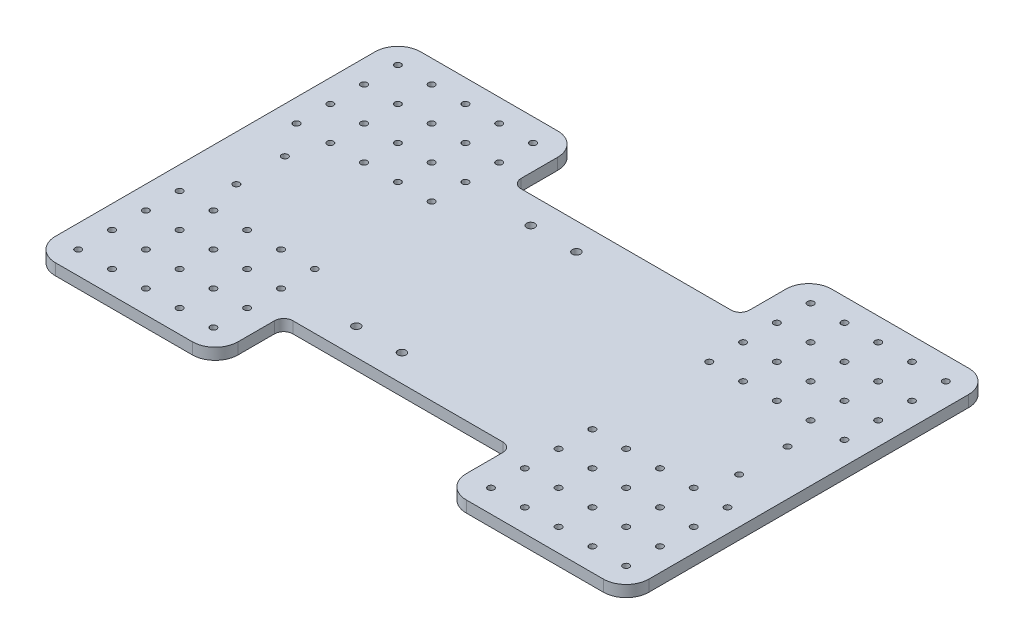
from build123d import *

# Parameters (mm, degrees)
SKETCH2_W             = 165.1
SKETCH2_H             = 101.6
BOSS_EXTRUDE1_DEPTH   = 3.175
SKETCH6_W             = 63.5
SKETCH6_H             = 3.175
CUT_EXTRUDE2_DEPTH    = 19.05
F_4_40_TAPPED_HOLE3_D = 2.2606
F_2_56_TAPPED_HOLE1_D = 1.778
FILLET1_R             = 6.35
F_2_56_TAPPED_HOLE2_D = 1.778
LPATTERN1_COUNT       = 5
LPATTERN1_PITCH       = 9.398
LPATTERN1_COUNT_DIR2  = 4
LPATTERN1_PITCH_DIR2  = 9.398
MIRROR3_COPY_1_D      = 1.778
MIRROR3_COPY_2_D      = 1.778
MIRROR3_COPY_3_D      = 1.778
MIRROR3_COPY_4_D      = 1.778
MIRROR3_COPY_5_D      = 1.778
MIRROR3_COPY_6_D      = 1.778
MIRROR3_COPY_7_D      = 1.778
MIRROR3_COPY_8_D      = 1.778
MIRROR3_COPY_9_D      = 1.778
MIRROR3_COPY_10_D     = 1.778
MIRROR3_COPY_11_D     = 1.778
MIRROR3_COPY_12_D     = 1.778
MIRROR3_COPY_13_D     = 1.778
MIRROR3_COPY_14_D     = 1.778
MIRROR3_COPY_15_D     = 1.778
MIRROR3_COPY_16_D     = 1.778
MIRROR3_COPY_17_D     = 1.778
MIRROR3_COPY_18_D     = 1.778
MIRROR3_COPY_19_D     = 1.778
FILLET3_R             = 2.54
MIRROR4_COPY_1_D      = 1.778
MIRROR4_COPY_2_D      = 1.778
MIRROR4_COPY_3_D      = 1.778
MIRROR4_COPY_4_D      = 1.778
MIRROR4_COPY_5_D      = 1.778
MIRROR4_COPY_6_D      = 1.778
MIRROR4_COPY_7_D      = 1.778
MIRROR4_COPY_8_D      = 1.778
MIRROR4_COPY_9_D      = 1.778
MIRROR4_COPY_10_D     = 1.778
MIRROR4_COPY_11_D     = 1.778
MIRROR4_COPY_12_D     = 1.778
MIRROR4_COPY_13_D     = 1.778
MIRROR4_COPY_14_D     = 1.778
MIRROR4_COPY_15_D     = 1.778
MIRROR4_COPY_16_D     = 1.778
MIRROR4_COPY_17_D     = 1.778
MIRROR4_COPY_18_D     = 1.778
MIRROR4_COPY_19_D     = 1.778
MIRROR4_COPY_20_D     = 1.778
MIRROR4_COPY_21_D     = 1.778
MIRROR4_COPY_22_D     = 1.778
MIRROR4_COPY_23_D     = 1.778
MIRROR4_COPY_24_D     = 1.778
MIRROR4_COPY_25_D     = 1.778
MIRROR4_COPY_26_D     = 1.778
MIRROR4_COPY_27_D     = 1.778
MIRROR4_COPY_28_D     = 1.778
MIRROR4_COPY_29_D     = 1.778
MIRROR4_COPY_30_D     = 1.778
MIRROR4_COPY_31_D     = 1.778
MIRROR4_COPY_32_D     = 1.778
MIRROR4_COPY_33_D     = 1.778
MIRROR4_COPY_34_D     = 1.778
MIRROR4_COPY_35_D     = 1.778
MIRROR4_COPY_36_D     = 1.778
MIRROR4_COPY_37_D     = 1.778
MIRROR4_COPY_38_D     = 1.778
MIRROR4_COPY_39_D     = 1.778


with BuildPart() as part:
    # Sketch2 → Boss-Extrude1 (new body)
    with BuildSketch(Plane(origin=(0, 0, 0), x_dir=(1, 0, 0), z_dir=(0, 1, 0))):
        Rectangle(SKETCH2_W, SKETCH2_H)
    extrude(amount=BOSS_EXTRUDE1_DEPTH)

    # Sketch6 → Cut-Extrude2 (cut)
    with BuildSketch(Plane.XY.offset(50.8)):
        with Locations((0, 1.5875)):
            Rectangle(SKETCH6_W, SKETCH6_H)
    cut_extrude2 = extrude(amount=-CUT_EXTRUDE2_DEPTH, mode=Mode.SUBTRACT)

    # Mirror2: Cut-Extrude2 across plane
    add(cut_extrude2.mirror(Plane.XY), mode=Mode.SUBTRACT)

    # 4-40 Tapped Hole3 (through all)
    with Locations(Plane(origin=(0, 3.175, 0), x_dir=(1, 0, 0), z_dir=(0, 1, 0))):
        with Locations((-6.35, 24.257), (-6.35, -24.257), (-19.05, 24.257), (-19.05, -24.257)):
            Hole(F_4_40_TAPPED_HOLE3_D / 2)

    # 2-56 Tapped Hole1 (through all)
    with Locations(Plane(origin=(0, 0, 0), x_dir=(-1, 0, 0), z_dir=(0, -1, 0))):
        with Locations((69.920806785, -6.731), (69.920806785, 6.731)):
            f_2_56_tapped_hole1 = Hole(F_2_56_TAPPED_HOLE1_D / 2)

    # Fillet1
    fillet1_edges = [part.edges().sort_by_distance(p)[0] for p in [
        (-31.75, 1.5875, 50.8),
        (31.75, 1.5875, 50.8),
        (-31.75, 1.5875, -50.8),
        (31.75, 1.5875, -50.8),
        (82.55, 1.5875, 50.8),
        (-82.55, 1.5875, 50.8),
        (-82.55, 1.5875, -50.8),
        (82.55, 1.5875, -50.8),
    ]]
    fillet(fillet1_edges, radius=FILLET1_R)

    # 2-56 Tapped Hole2 (through all)
    with Locations(Plane(origin=(0, 3.175, 0), x_dir=(1, 0, 0), z_dir=(0, 1, 0))):
        with Locations((-76.2, 44.45)):
            f_2_56_tapped_hole2 = Hole(F_2_56_TAPPED_HOLE2_D / 2)

    # LPattern1: 2-56 Tapped Hole2 5 × 4
    with Locations(*[(i * LPATTERN1_PITCH, 0, j * LPATTERN1_PITCH_DIR2) for i in range(LPATTERN1_COUNT) for j in range(LPATTERN1_COUNT_DIR2) if (i, j) != (0, 0)]):
        add(f_2_56_tapped_hole2, mode=Mode.SUBTRACT)

    # Mirror3: 2-56 Tapped Hole2 across plane
    add(f_2_56_tapped_hole2.mirror(Plane.XY), mode=Mode.SUBTRACT)

    # Mirror3 copy 1 (through all)
    with Locations(Plane(origin=(0, 3.175, -9.398), x_dir=(1, 0, 0), z_dir=(0, 1, 0))):
        with Locations((-76.2, -44.45)):
            Hole(MIRROR3_COPY_1_D / 2)

    # Mirror3 copy 2 (through all)
    with Locations(Plane(origin=(0, 3.175, -18.796), x_dir=(1, 0, 0), z_dir=(0, 1, 0))):
        with Locations((-76.2, -44.45)):
            Hole(MIRROR3_COPY_2_D / 2)

    # Mirror3 copy 3 (through all)
    with Locations(Plane(origin=(0, 3.175, -28.194), x_dir=(1, 0, 0), z_dir=(0, 1, 0))):
        with Locations((-76.2, -44.45)):
            Hole(MIRROR3_COPY_3_D / 2)

    # Mirror3 copy 4 (through all)
    with Locations(Plane(origin=(9.398, 3.175, 0), x_dir=(1, 0, 0), z_dir=(0, 1, 0))):
        with Locations((-76.2, -44.45)):
            Hole(MIRROR3_COPY_4_D / 2)

    # Mirror3 copy 5 (through all)
    with Locations(Plane(origin=(9.398, 3.175, -9.398), x_dir=(1, 0, 0), z_dir=(0, 1, 0))):
        with Locations((-76.2, -44.45)):
            Hole(MIRROR3_COPY_5_D / 2)

    # Mirror3 copy 6 (through all)
    with Locations(Plane(origin=(9.398, 3.175, -18.796), x_dir=(1, 0, 0), z_dir=(0, 1, 0))):
        with Locations((-76.2, -44.45)):
            Hole(MIRROR3_COPY_6_D / 2)

    # Mirror3 copy 7 (through all)
    with Locations(Plane(origin=(9.398, 3.175, -28.194), x_dir=(1, 0, 0), z_dir=(0, 1, 0))):
        with Locations((-76.2, -44.45)):
            Hole(MIRROR3_COPY_7_D / 2)

    # Mirror3 copy 8 (through all)
    with Locations(Plane(origin=(18.796, 3.175, 0), x_dir=(1, 0, 0), z_dir=(0, 1, 0))):
        with Locations((-76.2, -44.45)):
            Hole(MIRROR3_COPY_8_D / 2)

    # Mirror3 copy 9 (through all)
    with Locations(Plane(origin=(18.796, 3.175, -9.398), x_dir=(1, 0, 0), z_dir=(0, 1, 0))):
        with Locations((-76.2, -44.45)):
            Hole(MIRROR3_COPY_9_D / 2)

    # Mirror3 copy 10 (through all)
    with Locations(Plane(origin=(18.796, 3.175, -18.796), x_dir=(1, 0, 0), z_dir=(0, 1, 0))):
        with Locations((-76.2, -44.45)):
            Hole(MIRROR3_COPY_10_D / 2)

    # Mirror3 copy 11 (through all)
    with Locations(Plane(origin=(18.796, 3.175, -28.194), x_dir=(1, 0, 0), z_dir=(0, 1, 0))):
        with Locations((-76.2, -44.45)):
            Hole(MIRROR3_COPY_11_D / 2)

    # Mirror3 copy 12 (through all)
    with Locations(Plane(origin=(28.194, 3.175, 0), x_dir=(1, 0, 0), z_dir=(0, 1, 0))):
        with Locations((-76.2, -44.45)):
            Hole(MIRROR3_COPY_12_D / 2)

    # Mirror3 copy 13 (through all)
    with Locations(Plane(origin=(28.194, 3.175, -9.398), x_dir=(1, 0, 0), z_dir=(0, 1, 0))):
        with Locations((-76.2, -44.45)):
            Hole(MIRROR3_COPY_13_D / 2)

    # Mirror3 copy 14 (through all)
    with Locations(Plane(origin=(28.194, 3.175, -18.796), x_dir=(1, 0, 0), z_dir=(0, 1, 0))):
        with Locations((-76.2, -44.45)):
            Hole(MIRROR3_COPY_14_D / 2)

    # Mirror3 copy 15 (through all)
    with Locations(Plane(origin=(28.194, 3.175, -28.194), x_dir=(1, 0, 0), z_dir=(0, 1, 0))):
        with Locations((-76.2, -44.45)):
            Hole(MIRROR3_COPY_15_D / 2)

    # Mirror3 copy 16 (through all)
    with Locations(Plane(origin=(37.592, 3.175, 0), x_dir=(1, 0, 0), z_dir=(0, 1, 0))):
        with Locations((-76.2, -44.45)):
            Hole(MIRROR3_COPY_16_D / 2)

    # Mirror3 copy 17 (through all)
    with Locations(Plane(origin=(37.592, 3.175, -9.398), x_dir=(1, 0, 0), z_dir=(0, 1, 0))):
        with Locations((-76.2, -44.45)):
            Hole(MIRROR3_COPY_17_D / 2)

    # Mirror3 copy 18 (through all)
    with Locations(Plane(origin=(37.592, 3.175, -18.796), x_dir=(1, 0, 0), z_dir=(0, 1, 0))):
        with Locations((-76.2, -44.45)):
            Hole(MIRROR3_COPY_18_D / 2)

    # Mirror3 copy 19 (through all)
    with Locations(Plane(origin=(37.592, 3.175, -28.194), x_dir=(1, 0, 0), z_dir=(0, 1, 0))):
        with Locations((-76.2, -44.45)):
            Hole(MIRROR3_COPY_19_D / 2)

    # Fillet3
    fillet3_edges = [part.edges().sort_by_distance(p)[0] for p in [
        (31.75, 1.5875, 31.75),
        (-31.75, 1.5875, 31.75),
        (-31.75, 1.5875, -31.75),
        (31.75, 1.5875, -31.75),
    ]]
    fillet(fillet3_edges, radius=FILLET3_R)

    # Mirror4: 2-56 Tapped Hole1, 2-56 Tapped Hole2 across plane
    add(f_2_56_tapped_hole1.mirror(Plane.ZY), mode=Mode.SUBTRACT)
    add(f_2_56_tapped_hole2.mirror(Plane.ZY), mode=Mode.SUBTRACT)

    # Mirror4 copy 1 (through all)
    with Locations(Plane(origin=(0, 3.175, 9.398), x_dir=(-1, 0, 0), z_dir=(0, 1, 0))):
        with Locations((-76.2, -44.45)):
            Hole(MIRROR4_COPY_1_D / 2)

    # Mirror4 copy 2 (through all)
    with Locations(Plane(origin=(0, 3.175, 18.796), x_dir=(-1, 0, 0), z_dir=(0, 1, 0))):
        with Locations((-76.2, -44.45)):
            Hole(MIRROR4_COPY_2_D / 2)

    # Mirror4 copy 3 (through all)
    with Locations(Plane(origin=(0, 3.175, 28.194), x_dir=(-1, 0, 0), z_dir=(0, 1, 0))):
        with Locations((-76.2, -44.45)):
            Hole(MIRROR4_COPY_3_D / 2)

    # Mirror4 copy 4 (through all)
    with Locations(Plane(origin=(-9.398, 3.175, 0), x_dir=(-1, 0, 0), z_dir=(0, 1, 0))):
        with Locations((-76.2, -44.45)):
            Hole(MIRROR4_COPY_4_D / 2)

    # Mirror4 copy 5 (through all)
    with Locations(Plane(origin=(-9.398, 3.175, 9.398), x_dir=(-1, 0, 0), z_dir=(0, 1, 0))):
        with Locations((-76.2, -44.45)):
            Hole(MIRROR4_COPY_5_D / 2)

    # Mirror4 copy 6 (through all)
    with Locations(Plane(origin=(-9.398, 3.175, 18.796), x_dir=(-1, 0, 0), z_dir=(0, 1, 0))):
        with Locations((-76.2, -44.45)):
            Hole(MIRROR4_COPY_6_D / 2)

    # Mirror4 copy 7 (through all)
    with Locations(Plane(origin=(-9.398, 3.175, 28.194), x_dir=(-1, 0, 0), z_dir=(0, 1, 0))):
        with Locations((-76.2, -44.45)):
            Hole(MIRROR4_COPY_7_D / 2)

    # Mirror4 copy 8 (through all)
    with Locations(Plane(origin=(-18.796, 3.175, 0), x_dir=(-1, 0, 0), z_dir=(0, 1, 0))):
        with Locations((-76.2, -44.45)):
            Hole(MIRROR4_COPY_8_D / 2)

    # Mirror4 copy 9 (through all)
    with Locations(Plane(origin=(-18.796, 3.175, 9.398), x_dir=(-1, 0, 0), z_dir=(0, 1, 0))):
        with Locations((-76.2, -44.45)):
            Hole(MIRROR4_COPY_9_D / 2)

    # Mirror4 copy 10 (through all)
    with Locations(Plane(origin=(-18.796, 3.175, 18.796), x_dir=(-1, 0, 0), z_dir=(0, 1, 0))):
        with Locations((-76.2, -44.45)):
            Hole(MIRROR4_COPY_10_D / 2)

    # Mirror4 copy 11 (through all)
    with Locations(Plane(origin=(-18.796, 3.175, 28.194), x_dir=(-1, 0, 0), z_dir=(0, 1, 0))):
        with Locations((-76.2, -44.45)):
            Hole(MIRROR4_COPY_11_D / 2)

    # Mirror4 copy 12 (through all)
    with Locations(Plane(origin=(-28.194, 3.175, 0), x_dir=(-1, 0, 0), z_dir=(0, 1, 0))):
        with Locations((-76.2, -44.45)):
            Hole(MIRROR4_COPY_12_D / 2)

    # Mirror4 copy 13 (through all)
    with Locations(Plane(origin=(-28.194, 3.175, 9.398), x_dir=(-1, 0, 0), z_dir=(0, 1, 0))):
        with Locations((-76.2, -44.45)):
            Hole(MIRROR4_COPY_13_D / 2)

    # Mirror4 copy 14 (through all)
    with Locations(Plane(origin=(-28.194, 3.175, 18.796), x_dir=(-1, 0, 0), z_dir=(0, 1, 0))):
        with Locations((-76.2, -44.45)):
            Hole(MIRROR4_COPY_14_D / 2)

    # Mirror4 copy 15 (through all)
    with Locations(Plane(origin=(-28.194, 3.175, 28.194), x_dir=(-1, 0, 0), z_dir=(0, 1, 0))):
        with Locations((-76.2, -44.45)):
            Hole(MIRROR4_COPY_15_D / 2)

    # Mirror4 copy 16 (through all)
    with Locations(Plane(origin=(-37.592, 3.175, 0), x_dir=(-1, 0, 0), z_dir=(0, 1, 0))):
        with Locations((-76.2, -44.45)):
            Hole(MIRROR4_COPY_16_D / 2)

    # Mirror4 copy 17 (through all)
    with Locations(Plane(origin=(-37.592, 3.175, 9.398), x_dir=(-1, 0, 0), z_dir=(0, 1, 0))):
        with Locations((-76.2, -44.45)):
            Hole(MIRROR4_COPY_17_D / 2)

    # Mirror4 copy 18 (through all)
    with Locations(Plane(origin=(-37.592, 3.175, 18.796), x_dir=(-1, 0, 0), z_dir=(0, 1, 0))):
        with Locations((-76.2, -44.45)):
            Hole(MIRROR4_COPY_18_D / 2)

    # Mirror4 copy 19 (through all)
    with Locations(Plane(origin=(-37.592, 3.175, 28.194), x_dir=(-1, 0, 0), z_dir=(0, 1, 0))):
        with Locations((-76.2, -44.45)):
            Hole(MIRROR4_COPY_19_D / 2)

    # Mirror4 copy 20 (through all)
    with Locations(Plane(origin=(0, 3.175, 0), x_dir=(-1, 0, 0), z_dir=(0, 1, 0))):
        with Locations((-76.2, 44.45)):
            Hole(MIRROR4_COPY_20_D / 2)

    # Mirror4 copy 21 (through all)
    with Locations(Plane(origin=(0, 3.175, -9.398), x_dir=(-1, 0, 0), z_dir=(0, 1, 0))):
        with Locations((-76.2, 44.45)):
            Hole(MIRROR4_COPY_21_D / 2)

    # Mirror4 copy 22 (through all)
    with Locations(Plane(origin=(0, 3.175, -18.796), x_dir=(-1, 0, 0), z_dir=(0, 1, 0))):
        with Locations((-76.2, 44.45)):
            Hole(MIRROR4_COPY_22_D / 2)

    # Mirror4 copy 23 (through all)
    with Locations(Plane(origin=(0, 3.175, -28.194), x_dir=(-1, 0, 0), z_dir=(0, 1, 0))):
        with Locations((-76.2, 44.45)):
            Hole(MIRROR4_COPY_23_D / 2)

    # Mirror4 copy 24 (through all)
    with Locations(Plane(origin=(-9.398, 3.175, 0), x_dir=(-1, 0, 0), z_dir=(0, 1, 0))):
        with Locations((-76.2, 44.45)):
            Hole(MIRROR4_COPY_24_D / 2)

    # Mirror4 copy 25 (through all)
    with Locations(Plane(origin=(-9.398, 3.175, -9.398), x_dir=(-1, 0, 0), z_dir=(0, 1, 0))):
        with Locations((-76.2, 44.45)):
            Hole(MIRROR4_COPY_25_D / 2)

    # Mirror4 copy 26 (through all)
    with Locations(Plane(origin=(-9.398, 3.175, -18.796), x_dir=(-1, 0, 0), z_dir=(0, 1, 0))):
        with Locations((-76.2, 44.45)):
            Hole(MIRROR4_COPY_26_D / 2)

    # Mirror4 copy 27 (through all)
    with Locations(Plane(origin=(-9.398, 3.175, -28.194), x_dir=(-1, 0, 0), z_dir=(0, 1, 0))):
        with Locations((-76.2, 44.45)):
            Hole(MIRROR4_COPY_27_D / 2)

    # Mirror4 copy 28 (through all)
    with Locations(Plane(origin=(-18.796, 3.175, 0), x_dir=(-1, 0, 0), z_dir=(0, 1, 0))):
        with Locations((-76.2, 44.45)):
            Hole(MIRROR4_COPY_28_D / 2)

    # Mirror4 copy 29 (through all)
    with Locations(Plane(origin=(-18.796, 3.175, -9.398), x_dir=(-1, 0, 0), z_dir=(0, 1, 0))):
        with Locations((-76.2, 44.45)):
            Hole(MIRROR4_COPY_29_D / 2)

    # Mirror4 copy 30 (through all)
    with Locations(Plane(origin=(-18.796, 3.175, -18.796), x_dir=(-1, 0, 0), z_dir=(0, 1, 0))):
        with Locations((-76.2, 44.45)):
            Hole(MIRROR4_COPY_30_D / 2)

    # Mirror4 copy 31 (through all)
    with Locations(Plane(origin=(-18.796, 3.175, -28.194), x_dir=(-1, 0, 0), z_dir=(0, 1, 0))):
        with Locations((-76.2, 44.45)):
            Hole(MIRROR4_COPY_31_D / 2)

    # Mirror4 copy 32 (through all)
    with Locations(Plane(origin=(-28.194, 3.175, 0), x_dir=(-1, 0, 0), z_dir=(0, 1, 0))):
        with Locations((-76.2, 44.45)):
            Hole(MIRROR4_COPY_32_D / 2)

    # Mirror4 copy 33 (through all)
    with Locations(Plane(origin=(-28.194, 3.175, -9.398), x_dir=(-1, 0, 0), z_dir=(0, 1, 0))):
        with Locations((-76.2, 44.45)):
            Hole(MIRROR4_COPY_33_D / 2)

    # Mirror4 copy 34 (through all)
    with Locations(Plane(origin=(-28.194, 3.175, -18.796), x_dir=(-1, 0, 0), z_dir=(0, 1, 0))):
        with Locations((-76.2, 44.45)):
            Hole(MIRROR4_COPY_34_D / 2)

    # Mirror4 copy 35 (through all)
    with Locations(Plane(origin=(-28.194, 3.175, -28.194), x_dir=(-1, 0, 0), z_dir=(0, 1, 0))):
        with Locations((-76.2, 44.45)):
            Hole(MIRROR4_COPY_35_D / 2)

    # Mirror4 copy 36 (through all)
    with Locations(Plane(origin=(-37.592, 3.175, 0), x_dir=(-1, 0, 0), z_dir=(0, 1, 0))):
        with Locations((-76.2, 44.45)):
            Hole(MIRROR4_COPY_36_D / 2)

    # Mirror4 copy 37 (through all)
    with Locations(Plane(origin=(-37.592, 3.175, -9.398), x_dir=(-1, 0, 0), z_dir=(0, 1, 0))):
        with Locations((-76.2, 44.45)):
            Hole(MIRROR4_COPY_37_D / 2)

    # Mirror4 copy 38 (through all)
    with Locations(Plane(origin=(-37.592, 3.175, -18.796), x_dir=(-1, 0, 0), z_dir=(0, 1, 0))):
        with Locations((-76.2, 44.45)):
            Hole(MIRROR4_COPY_38_D / 2)

    # Mirror4 copy 39 (through all)
    with Locations(Plane(origin=(-37.592, 3.175, -28.194), x_dir=(-1, 0, 0), z_dir=(0, 1, 0))):
        with Locations((-76.2, 44.45)):
            Hole(MIRROR4_COPY_39_D / 2)


solid = part.part
